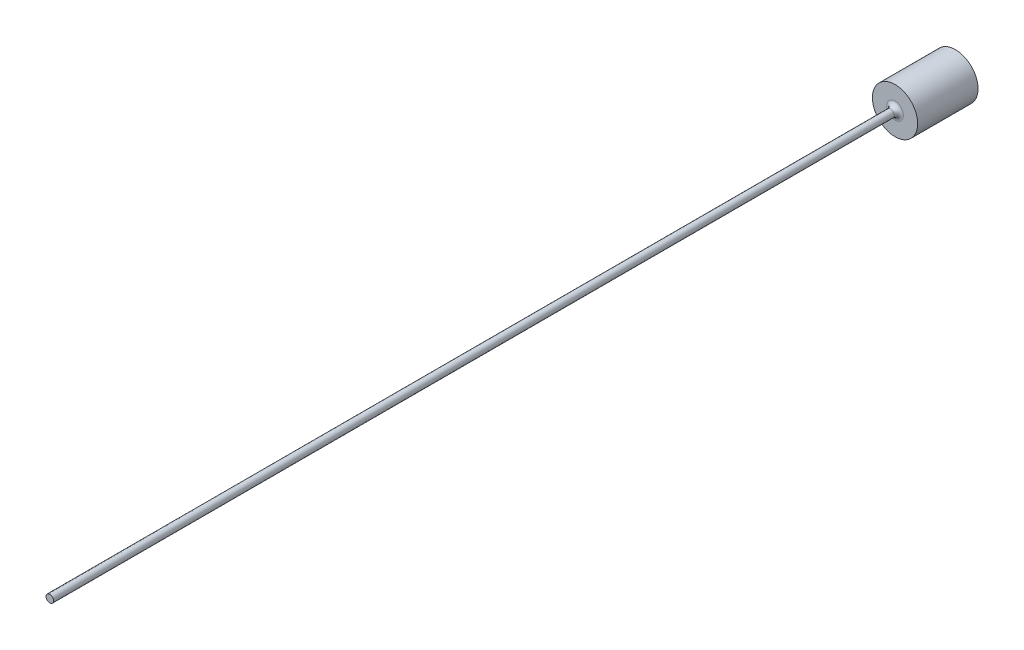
from build123d import *

# Parameters (mm, degrees)
FILLET1_R = 0.3


with BuildPart() as part:
    # FV → Revolve1 (revolve)
    with BuildSketch(Plane(origin=(0, 0, 0), x_dir=(1, 0, 0), z_dir=(0, 1, 0)), mode=Mode.PRIVATE) as revolve1_sk:
        Polygon((0, 0), (1.5, 0), (1.5, -4), (0.25, -4), (0.25, -60), (0, -60), align=None)
    revolve(revolve1_sk.sketch.rotate(Axis((0, 0, -9.033228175), (0, 0, 1)), 180), axis=Axis((0, 0, -9.033228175), (0, 0, 1)))

    # Fillet1
    fillet1_edges = [part.edges().sort_by_distance(p)[0] for p in [
        (0.25, 0, 4),
    ]]
    fillet(fillet1_edges, radius=FILLET1_R)


solid = part.part
